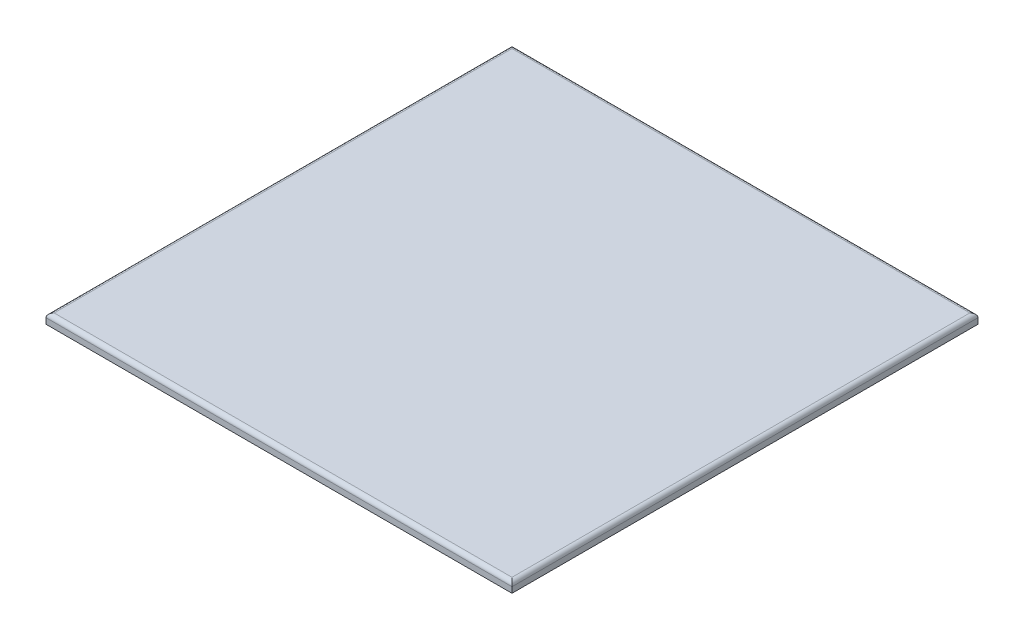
ISO-10303-21;
HEADER;
FILE_DESCRIPTION(('STEP AP214'),'2;1');
FILE_NAME('part.step','',(''),(''),'','','');
FILE_SCHEMA(('AUTOMOTIVE_DESIGN { 1 0 10303 214 1 1 1 1 }'));
ENDSEC;
DATA;
#1=APPLICATION_CONTEXT('core data for automotive mechanical design processes');
#2=APPLICATION_PROTOCOL_DEFINITION('international standard','automotive_design',2000,#1);
#3=PRODUCT_CONTEXT('',#1,'mechanical');
#4=PRODUCT('Part','Part','',(#3));
#5=PRODUCT_RELATED_PRODUCT_CATEGORY('part','',(#4));
#6=PRODUCT_DEFINITION_FORMATION('','',#4);
#7=PRODUCT_DEFINITION_CONTEXT('part definition',#1,'design');
#8=PRODUCT_DEFINITION('design','',#6,#7);
#9=PRODUCT_DEFINITION_SHAPE('','',#8);
#10=(LENGTH_UNIT() NAMED_UNIT(*) SI_UNIT(.MILLI.,.METRE.));
#11=(NAMED_UNIT(*) PLANE_ANGLE_UNIT() SI_UNIT($,.RADIAN.));
#12=(NAMED_UNIT(*) SI_UNIT($,.STERADIAN.) SOLID_ANGLE_UNIT());
#13=UNCERTAINTY_MEASURE_WITH_UNIT(LENGTH_MEASURE(1.E-05),#10,'distance_accuracy_value','');
#14=(GEOMETRIC_REPRESENTATION_CONTEXT(3) GLOBAL_UNCERTAINTY_ASSIGNED_CONTEXT((#13)) GLOBAL_UNIT_ASSIGNED_CONTEXT((#10,
#11,#12)) REPRESENTATION_CONTEXT('',''));
#15=CARTESIAN_POINT('',(0.,0.,0.));
#16=DIRECTION('',(0.,0.,1.));
#17=DIRECTION('',(1.,0.,0.));
#18=AXIS2_PLACEMENT_3D('',#15,#16,#17);
#19=CARTESIAN_POINT('',(0.,3.048,0.));
#20=DIRECTION('',(1.,0.,0.));
#21=DIRECTION('',(0.,0.,-1.));
#22=AXIS2_PLACEMENT_3D('',#19,#20,#21);
#23=PLANE('',#22);
#24=DIRECTION('',(0.,-1.,0.));
#25=VECTOR('',#24,1.);
#26=CARTESIAN_POINT('',(0.,3.048,0.));
#27=LINE('',#26,#25);
#28=CARTESIAN_POINT('',(0.,1.778,0.));
#29=VERTEX_POINT('',#28);
#30=CARTESIAN_POINT('',(0.,0.,0.));
#31=VERTEX_POINT('',#30);
#32=EDGE_CURVE('E93',#29,#31,#27,.T.);
#33=ORIENTED_EDGE('',*,*,#32,.F.);
#34=DIRECTION('',(0.,0.,1.));
#35=VECTOR('',#34,1.);
#36=CARTESIAN_POINT('',(0.,1.778,0.));
#37=LINE('',#36,#35);
#38=CARTESIAN_POINT('',(0.,1.778,-145.));
#39=VERTEX_POINT('',#38);
#40=EDGE_CURVE('E11',#29,#39,#37,.F.);
#41=ORIENTED_EDGE('',*,*,#40,.T.);
#42=DIRECTION('',(0.,-1.,0.));
#43=VECTOR('',#42,1.);
#44=CARTESIAN_POINT('',(0.,3.048,-145.));
#45=LINE('',#44,#43);
#46=CARTESIAN_POINT('',(0.,0.,-145.));
#47=VERTEX_POINT('',#46);
#48=EDGE_CURVE('E115',#39,#47,#45,.T.);
#49=ORIENTED_EDGE('',*,*,#48,.T.);
#50=DIRECTION('',(0.,0.,1.));
#51=VECTOR('',#50,1.);
#52=CARTESIAN_POINT('',(0.,0.,0.));
#53=LINE('',#52,#51);
#54=EDGE_CURVE('E110',#47,#31,#53,.T.);
#55=ORIENTED_EDGE('',*,*,#54,.T.);
#56=EDGE_LOOP('',(#33,#41,#49,#55));
#57=FACE_BOUND('',#56,.T.);
#58=ADVANCED_FACE('F39',(#57),#23,.F.);
#59=CARTESIAN_POINT('',(0.,3.048,0.));
#60=DIRECTION('',(0.,0.,-1.));
#61=DIRECTION('',(-1.,0.,0.));
#62=AXIS2_PLACEMENT_3D('',#59,#60,#61);
#63=PLANE('',#62);
#64=DIRECTION('',(0.,-1.,0.));
#65=VECTOR('',#64,1.);
#66=CARTESIAN_POINT('',(145.,3.048,0.));
#67=LINE('',#66,#65);
#68=CARTESIAN_POINT('',(145.,1.778,0.));
#69=VERTEX_POINT('',#68);
#70=CARTESIAN_POINT('',(145.,0.,0.));
#71=VERTEX_POINT('',#70);
#72=EDGE_CURVE('E104',#69,#71,#67,.T.);
#73=ORIENTED_EDGE('',*,*,#72,.F.);
#74=DIRECTION('',(1.,0.,0.));
#75=VECTOR('',#74,1.);
#76=CARTESIAN_POINT('',(0.,1.778,0.));
#77=LINE('',#76,#75);
#78=EDGE_CURVE('E100',#69,#29,#77,.F.);
#79=ORIENTED_EDGE('',*,*,#78,.T.);
#80=ORIENTED_EDGE('',*,*,#32,.T.);
#81=DIRECTION('',(1.,0.,0.));
#82=VECTOR('',#81,1.);
#83=CARTESIAN_POINT('',(0.,0.,0.));
#84=LINE('',#83,#82);
#85=EDGE_CURVE('E97',#31,#71,#84,.T.);
#86=ORIENTED_EDGE('',*,*,#85,.T.);
#87=EDGE_LOOP('',(#73,#79,#80,#86));
#88=FACE_BOUND('',#87,.T.);
#89=ADVANCED_FACE('F96',(#88),#63,.F.);
#90=CARTESIAN_POINT('',(145.,3.048,0.));
#91=DIRECTION('',(-1.,0.,0.));
#92=DIRECTION('',(0.,0.,1.));
#93=AXIS2_PLACEMENT_3D('',#90,#91,#92);
#94=PLANE('',#93);
#95=DIRECTION('',(0.,-1.,0.));
#96=VECTOR('',#95,1.);
#97=CARTESIAN_POINT('',(145.,3.048,-145.));
#98=LINE('',#97,#96);
#99=CARTESIAN_POINT('',(145.,1.778,-145.));
#100=VERTEX_POINT('',#99);
#101=CARTESIAN_POINT('',(145.,0.,-145.));
#102=VERTEX_POINT('',#101);
#103=EDGE_CURVE('E130',#100,#102,#98,.T.);
#104=ORIENTED_EDGE('',*,*,#103,.F.);
#105=DIRECTION('',(0.,0.,-1.));
#106=VECTOR('',#105,1.);
#107=CARTESIAN_POINT('',(145.,1.778,0.));
#108=LINE('',#107,#106);
#109=EDGE_CURVE('E149',#100,#69,#108,.F.);
#110=ORIENTED_EDGE('',*,*,#109,.T.);
#111=ORIENTED_EDGE('',*,*,#72,.T.);
#112=DIRECTION('',(0.,0.,-1.));
#113=VECTOR('',#112,1.);
#114=CARTESIAN_POINT('',(145.,0.,0.));
#115=LINE('',#114,#113);
#116=EDGE_CURVE('E112',#71,#102,#115,.T.);
#117=ORIENTED_EDGE('',*,*,#116,.T.);
#118=EDGE_LOOP('',(#104,#110,#111,#117));
#119=FACE_BOUND('',#118,.T.);
#120=ADVANCED_FACE('F190',(#119),#94,.F.);
#121=CARTESIAN_POINT('',(0.,3.048,-145.));
#122=DIRECTION('',(0.,0.,1.));
#123=DIRECTION('',(1.,0.,0.));
#124=AXIS2_PLACEMENT_3D('',#121,#122,#123);
#125=PLANE('',#124);
#126=ORIENTED_EDGE('',*,*,#48,.F.);
#127=DIRECTION('',(-1.,0.,0.));
#128=VECTOR('',#127,1.);
#129=CARTESIAN_POINT('',(0.,1.778,-145.));
#130=LINE('',#129,#128);
#131=EDGE_CURVE('E49',#39,#100,#130,.F.);
#132=ORIENTED_EDGE('',*,*,#131,.T.);
#133=ORIENTED_EDGE('',*,*,#103,.T.);
#134=DIRECTION('',(-1.,0.,0.));
#135=VECTOR('',#134,1.);
#136=CARTESIAN_POINT('',(0.,0.,-145.));
#137=LINE('',#136,#135);
#138=EDGE_CURVE('E125',#102,#47,#137,.T.);
#139=ORIENTED_EDGE('',*,*,#138,.T.);
#140=EDGE_LOOP('',(#126,#132,#133,#139));
#141=FACE_BOUND('',#140,.T.);
#142=ADVANCED_FACE('F222',(#141),#125,.F.);
#143=CARTESIAN_POINT('',(0.,3.048,0.));
#144=DIRECTION('',(0.,-1.,0.));
#145=DIRECTION('',(0.,0.,-1.));
#146=AXIS2_PLACEMENT_3D('',#143,#144,#145);
#147=PLANE('',#146);
#148=DIRECTION('',(0.,0.,1.));
#149=VECTOR('',#148,1.);
#150=CARTESIAN_POINT('',(1.27,3.048,0.));
#151=LINE('',#150,#149);
#152=CARTESIAN_POINT('',(1.27,3.048,-143.73));
#153=VERTEX_POINT('',#152);
#154=CARTESIAN_POINT('',(1.27,3.048,-1.27));
#155=VERTEX_POINT('',#154);
#156=EDGE_CURVE('E103',#153,#155,#151,.T.);
#157=ORIENTED_EDGE('',*,*,#156,.T.);
#158=DIRECTION('',(1.,0.,0.));
#159=VECTOR('',#158,1.);
#160=CARTESIAN_POINT('',(0.,3.048,-1.27));
#161=LINE('',#160,#159);
#162=CARTESIAN_POINT('',(143.73,3.048,-1.27));
#163=VERTEX_POINT('',#162);
#164=EDGE_CURVE('E143',#155,#163,#161,.T.);
#165=ORIENTED_EDGE('',*,*,#164,.T.);
#166=DIRECTION('',(0.,0.,-1.));
#167=VECTOR('',#166,1.);
#168=CARTESIAN_POINT('',(143.73,3.048,0.));
#169=LINE('',#168,#167);
#170=CARTESIAN_POINT('',(143.73,3.048,-143.73));
#171=VERTEX_POINT('',#170);
#172=EDGE_CURVE('E140',#163,#171,#169,.T.);
#173=ORIENTED_EDGE('',*,*,#172,.T.);
#174=DIRECTION('',(-1.,0.,0.));
#175=VECTOR('',#174,1.);
#176=CARTESIAN_POINT('',(0.,3.048,-143.73));
#177=LINE('',#176,#175);
#178=EDGE_CURVE('E137',#171,#153,#177,.T.);
#179=ORIENTED_EDGE('',*,*,#178,.T.);
#180=EDGE_LOOP('',(#157,#165,#173,#179));
#181=FACE_BOUND('',#180,.T.);
#182=ADVANCED_FACE('F172',(#181),#147,.F.);
#183=CARTESIAN_POINT('',(0.,0.,0.));
#184=DIRECTION('',(0.,-1.,0.));
#185=DIRECTION('',(0.,0.,-1.));
#186=AXIS2_PLACEMENT_3D('',#183,#184,#185);
#187=PLANE('',#186);
#188=ORIENTED_EDGE('',*,*,#54,.F.);
#189=ORIENTED_EDGE('',*,*,#138,.F.);
#190=ORIENTED_EDGE('',*,*,#116,.F.);
#191=ORIENTED_EDGE('',*,*,#85,.F.);
#192=EDGE_LOOP('',(#188,#189,#190,#191));
#193=FACE_BOUND('',#192,.T.);
#194=ADVANCED_FACE('F108',(#193),#187,.T.);
#195=CARTESIAN_POINT('',(0.,1.778,-143.73));
#196=DIRECTION('',(-1.,0.,0.));
#197=DIRECTION('',(0.,0.,1.));
#198=AXIS2_PLACEMENT_3D('',#195,#196,#197);
#199=CYLINDRICAL_SURFACE('',#198,1.27);
#200=CARTESIAN_POINT('',(143.73,1.778,-143.73));
#201=DIRECTION('',(-0.707106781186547,0.,-0.707106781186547));
#202=DIRECTION('',(-0.707106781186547,0.,0.707106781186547));
#203=AXIS2_PLACEMENT_3D('',#200,#201,#202);
#204=ELLIPSE('',#203,1.79605122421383,1.27);
#205=EDGE_CURVE('E121',#100,#171,#204,.F.);
#206=ORIENTED_EDGE('',*,*,#205,.F.);
#207=ORIENTED_EDGE('',*,*,#131,.F.);
#208=CARTESIAN_POINT('',(1.27,1.778,-143.73));
#209=DIRECTION('',(-0.707106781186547,0.,0.707106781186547));
#210=DIRECTION('',(0.707106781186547,0.,0.707106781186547));
#211=AXIS2_PLACEMENT_3D('',#208,#209,#210);
#212=ELLIPSE('',#211,1.79605122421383,1.27);
#213=EDGE_CURVE('E43',#153,#39,#212,.T.);
#214=ORIENTED_EDGE('',*,*,#213,.F.);
#215=ORIENTED_EDGE('',*,*,#178,.F.);
#216=EDGE_LOOP('',(#206,#207,#214,#215));
#217=FACE_BOUND('',#216,.T.);
#218=ADVANCED_FACE('F41',(#217),#199,.T.);
#219=CARTESIAN_POINT('',(1.27,1.778,0.));
#220=DIRECTION('',(0.,0.,1.));
#221=DIRECTION('',(1.,0.,0.));
#222=AXIS2_PLACEMENT_3D('',#219,#220,#221);
#223=CYLINDRICAL_SURFACE('',#222,1.27);
#224=ORIENTED_EDGE('',*,*,#213,.T.);
#225=ORIENTED_EDGE('',*,*,#40,.F.);
#226=CARTESIAN_POINT('',(1.27,1.778,-1.27));
#227=DIRECTION('',(0.707106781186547,0.,0.707106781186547));
#228=DIRECTION('',(-0.707106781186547,0.,0.707106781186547));
#229=AXIS2_PLACEMENT_3D('',#226,#227,#228);
#230=ELLIPSE('',#229,1.79605122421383,1.27);
#231=EDGE_CURVE('E157',#155,#29,#230,.T.);
#232=ORIENTED_EDGE('',*,*,#231,.F.);
#233=ORIENTED_EDGE('',*,*,#156,.F.);
#234=EDGE_LOOP('',(#224,#225,#232,#233));
#235=FACE_BOUND('',#234,.T.);
#236=ADVANCED_FACE('F178',(#235),#223,.T.);
#237=CARTESIAN_POINT('',(143.73,1.778,0.));
#238=DIRECTION('',(0.,0.,-1.));
#239=DIRECTION('',(-1.,0.,0.));
#240=AXIS2_PLACEMENT_3D('',#237,#238,#239);
#241=CYLINDRICAL_SURFACE('',#240,1.27);
#242=ORIENTED_EDGE('',*,*,#205,.T.);
#243=ORIENTED_EDGE('',*,*,#172,.F.);
#244=CARTESIAN_POINT('',(143.73,1.778,-1.27));
#245=DIRECTION('',(0.707106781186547,0.,-0.707106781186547));
#246=DIRECTION('',(-0.707106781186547,0.,-0.707106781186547));
#247=AXIS2_PLACEMENT_3D('',#244,#245,#246);
#248=ELLIPSE('',#247,1.79605122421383,1.27);
#249=EDGE_CURVE('E154',#69,#163,#248,.F.);
#250=ORIENTED_EDGE('',*,*,#249,.F.);
#251=ORIENTED_EDGE('',*,*,#109,.F.);
#252=EDGE_LOOP('',(#242,#243,#250,#251));
#253=FACE_BOUND('',#252,.T.);
#254=ADVANCED_FACE('F165',(#253),#241,.T.);
#255=CARTESIAN_POINT('',(0.,1.778,-1.27));
#256=DIRECTION('',(1.,0.,0.));
#257=DIRECTION('',(0.,0.,-1.));
#258=AXIS2_PLACEMENT_3D('',#255,#256,#257);
#259=CYLINDRICAL_SURFACE('',#258,1.27);
#260=ORIENTED_EDGE('',*,*,#231,.T.);
#261=ORIENTED_EDGE('',*,*,#78,.F.);
#262=ORIENTED_EDGE('',*,*,#249,.T.);
#263=ORIENTED_EDGE('',*,*,#164,.F.);
#264=EDGE_LOOP('',(#260,#261,#262,#263));
#265=FACE_BOUND('',#264,.T.);
#266=ADVANCED_FACE('F176',(#265),#259,.T.);
#267=CLOSED_SHELL('',(#58,#89,#120,#142,#182,#194,#218,#236,#254,#266));
#268=MANIFOLD_SOLID_BREP('B2',#267);
#269=ADVANCED_BREP_SHAPE_REPRESENTATION('',(#18,#268),#14);
#270=SHAPE_DEFINITION_REPRESENTATION(#9,#269);
ENDSEC;
END-ISO-10303-21;
